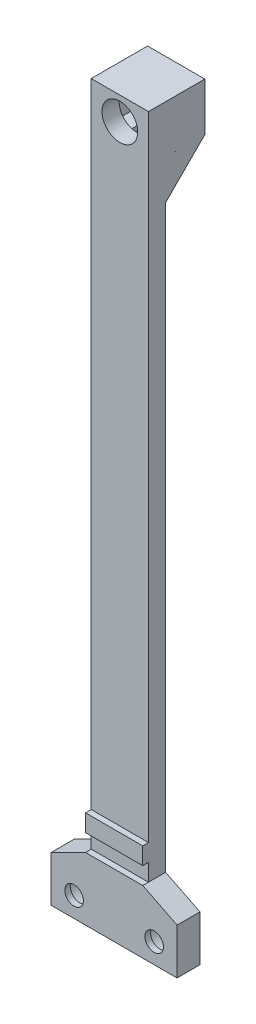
ISO-10303-21;
HEADER;
FILE_DESCRIPTION(('STEP AP214'),'2;1');
FILE_NAME('part.step','',(''),(''),'','','');
FILE_SCHEMA(('AUTOMOTIVE_DESIGN { 1 0 10303 214 1 1 1 1 }'));
ENDSEC;
DATA;
#1=APPLICATION_CONTEXT('core data for automotive mechanical design processes');
#2=APPLICATION_PROTOCOL_DEFINITION('international standard','automotive_design',2000,#1);
#3=PRODUCT_CONTEXT('',#1,'mechanical');
#4=PRODUCT('Part','Part','',(#3));
#5=PRODUCT_RELATED_PRODUCT_CATEGORY('part','',(#4));
#6=PRODUCT_DEFINITION_FORMATION('','',#4);
#7=PRODUCT_DEFINITION_CONTEXT('part definition',#1,'design');
#8=PRODUCT_DEFINITION('design','',#6,#7);
#9=PRODUCT_DEFINITION_SHAPE('','',#8);
#10=(LENGTH_UNIT() NAMED_UNIT(*) SI_UNIT(.MILLI.,.METRE.));
#11=(NAMED_UNIT(*) PLANE_ANGLE_UNIT() SI_UNIT($,.RADIAN.));
#12=(NAMED_UNIT(*) SI_UNIT($,.STERADIAN.) SOLID_ANGLE_UNIT());
#13=UNCERTAINTY_MEASURE_WITH_UNIT(LENGTH_MEASURE(1.E-05),#10,'distance_accuracy_value','');
#14=(GEOMETRIC_REPRESENTATION_CONTEXT(3) GLOBAL_UNCERTAINTY_ASSIGNED_CONTEXT((#13)) GLOBAL_UNIT_ASSIGNED_CONTEXT((#10,
#11,#12)) REPRESENTATION_CONTEXT('',''));
#15=CARTESIAN_POINT('',(0.,0.,0.));
#16=DIRECTION('',(0.,0.,1.));
#17=DIRECTION('',(1.,0.,0.));
#18=AXIS2_PLACEMENT_3D('',#15,#16,#17);
#19=CARTESIAN_POINT('',(0.,0.,0.));
#20=DIRECTION('',(0.,0.,-1.));
#21=DIRECTION('',(-1.,0.,0.));
#22=AXIS2_PLACEMENT_3D('',#19,#20,#21);
#23=PLANE('',#22);
#24=DIRECTION('',(-1.,0.,0.));
#25=VECTOR('',#24,1.);
#26=CARTESIAN_POINT('',(5.,54.698516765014,0.));
#27=LINE('',#26,#25);
#28=CARTESIAN_POINT('',(5.,54.698516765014,0.));
#29=VERTEX_POINT('',#28);
#30=CARTESIAN_POINT('',(-1.48874703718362,54.698516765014,0.));
#31=VERTEX_POINT('',#30);
#32=EDGE_CURVE('E418',#29,#31,#27,.T.);
#33=ORIENTED_EDGE('',*,*,#32,.T.);
#34=DIRECTION('',(0.,-1.,0.));
#35=VECTOR('',#34,1.);
#36=CARTESIAN_POINT('',(-1.4887470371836,0.,0.));
#37=LINE('',#36,#35);
#38=CARTESIAN_POINT('',(-1.48874703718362,55.498516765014,0.));
#39=VERTEX_POINT('',#38);
#40=EDGE_CURVE('E11',#39,#31,#37,.T.);
#41=ORIENTED_EDGE('',*,*,#40,.F.);
#42=DIRECTION('',(1.,0.,0.));
#43=VECTOR('',#42,1.);
#44=CARTESIAN_POINT('',(0.,55.498516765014,0.));
#45=LINE('',#44,#43);
#46=CARTESIAN_POINT('',(-4.2,55.498516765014,0.));
#47=VERTEX_POINT('',#46);
#48=EDGE_CURVE('E50',#47,#39,#45,.T.);
#49=ORIENTED_EDGE('',*,*,#48,.F.);
#50=DIRECTION('',(0.,-1.,0.));
#51=VECTOR('',#50,1.);
#52=CARTESIAN_POINT('',(-4.2,0.,0.));
#53=LINE('',#52,#51);
#54=CARTESIAN_POINT('',(-4.2,62.3185167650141,0.));
#55=VERTEX_POINT('',#54);
#56=EDGE_CURVE('E373',#55,#47,#53,.T.);
#57=ORIENTED_EDGE('',*,*,#56,.F.);
#58=DIRECTION('',(-1.,0.,0.));
#59=VECTOR('',#58,1.);
#60=CARTESIAN_POINT('',(0.,62.3185167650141,0.));
#61=LINE('',#60,#59);
#62=CARTESIAN_POINT('',(4.2,62.3185167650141,0.));
#63=VERTEX_POINT('',#62);
#64=EDGE_CURVE('E370',#63,#55,#61,.T.);
#65=ORIENTED_EDGE('',*,*,#64,.F.);
#66=DIRECTION('',(0.,1.,0.));
#67=VECTOR('',#66,1.);
#68=CARTESIAN_POINT('',(4.2,0.,0.));
#69=LINE('',#68,#67);
#70=CARTESIAN_POINT('',(4.2,55.4993335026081,0.));
#71=VERTEX_POINT('',#70);
#72=EDGE_CURVE('E367',#71,#63,#69,.T.);
#73=ORIENTED_EDGE('',*,*,#72,.F.);
#74=DIRECTION('',(1.,0.,0.));
#75=VECTOR('',#74,1.);
#76=CARTESIAN_POINT('',(1.18144171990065E-13,55.4993335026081,0.));
#77=LINE('',#76,#75);
#78=CARTESIAN_POINT('',(0.940389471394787,55.4993335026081,0.));
#79=VERTEX_POINT('',#78);
#80=EDGE_CURVE('E364',#79,#71,#77,.T.);
#81=ORIENTED_EDGE('',*,*,#80,.F.);
#82=DIRECTION('',(0.,1.,0.));
#83=VECTOR('',#82,1.);
#84=CARTESIAN_POINT('',(0.940389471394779,0.,0.));
#85=LINE('',#84,#83);
#86=CARTESIAN_POINT('',(0.940389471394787,54.6993335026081,0.));
#87=VERTEX_POINT('',#86);
#88=EDGE_CURVE('E361',#87,#79,#85,.T.);
#89=ORIENTED_EDGE('',*,*,#88,.F.);
#90=DIRECTION('',(-1.,0.,0.));
#91=VECTOR('',#90,1.);
#92=CARTESIAN_POINT('',(0.,54.6993335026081,0.));
#93=LINE('',#92,#91);
#94=CARTESIAN_POINT('',(5.,54.6993335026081,0.));
#95=VERTEX_POINT('',#94);
#96=EDGE_CURVE('E276',#95,#87,#93,.T.);
#97=ORIENTED_EDGE('',*,*,#96,.F.);
#98=DIRECTION('',(0.,1.,0.));
#99=VECTOR('',#98,1.);
#100=CARTESIAN_POINT('',(5.,-62.5,0.));
#101=LINE('',#100,#99);
#102=EDGE_CURVE('E346',#29,#95,#101,.T.);
#103=ORIENTED_EDGE('',*,*,#102,.F.);
#104=EDGE_LOOP('',(#33,#41,#49,#57,#65,#73,#81,#89,#97,#103));
#105=FACE_BOUND('',#104,.T.);
#106=CARTESIAN_POINT('',(0.,59.07,0.));
#107=DIRECTION('',(0.,0.,-1.));
#108=DIRECTION('',(-1.,0.,0.));
#109=AXIS2_PLACEMENT_3D('',#106,#107,#108);
#110=CIRCLE('',#109,3.125);
#111=CARTESIAN_POINT('',(-3.125,59.07,0.));
#112=VERTEX_POINT('',#111);
#113=EDGE_CURVE('E307',#112,#112,#110,.T.);
#114=ORIENTED_EDGE('',*,*,#113,.F.);
#115=EDGE_LOOP('',(#114));
#116=FACE_BOUND('',#115,.T.);
#117=ADVANCED_FACE('F41',(#105,#116),#23,.T.);
#118=CARTESIAN_POINT('',(-5.,-62.5,3.));
#119=DIRECTION('',(1.,0.,0.));
#120=DIRECTION('',(0.,0.,-1.));
#121=AXIS2_PLACEMENT_3D('',#118,#119,#120);
#122=PLANE('',#121);
#123=DIRECTION('',(0.,0.,-1.));
#124=VECTOR('',#123,1.);
#125=CARTESIAN_POINT('',(-5.,63.118516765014,3.));
#126=LINE('',#125,#124);
#127=CARTESIAN_POINT('',(-5.,63.118516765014,3.));
#128=VERTEX_POINT('',#127);
#129=CARTESIAN_POINT('',(-5.,63.118516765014,-6.84748427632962));
#130=VERTEX_POINT('',#129);
#131=EDGE_CURVE('E231',#128,#130,#126,.T.);
#132=ORIENTED_EDGE('',*,*,#131,.T.);
#133=DIRECTION('',(0.,-1.,0.));
#134=VECTOR('',#133,1.);
#135=CARTESIAN_POINT('',(-5.,51.8399888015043,-6.84748427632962));
#136=LINE('',#135,#134);
#137=CARTESIAN_POINT('',(-5.,54.698516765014,-6.84748427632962));
#138=VERTEX_POINT('',#137);
#139=EDGE_CURVE('E210',#130,#138,#136,.T.);
#140=ORIENTED_EDGE('',*,*,#139,.T.);
#141=DIRECTION('',(0.,-0.707106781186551,0.707106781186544));
#142=VECTOR('',#141,1.);
#143=CARTESIAN_POINT('',(-5.,54.698516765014,-6.84748427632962));
#144=LINE('',#143,#142);
#145=CARTESIAN_POINT('',(-5.,47.8510324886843,0.));
#146=VERTEX_POINT('',#145);
#147=EDGE_CURVE('E401',#138,#146,#144,.T.);
#148=ORIENTED_EDGE('',*,*,#147,.T.);
#149=DIRECTION('',(0.,-1.,0.));
#150=VECTOR('',#149,1.);
#151=CARTESIAN_POINT('',(-5.,-62.5,0.));
#152=LINE('',#151,#150);
#153=CARTESIAN_POINT('',(-5.,-53.5,0.));
#154=VERTEX_POINT('',#153);
#155=EDGE_CURVE('E355',#146,#154,#152,.T.);
#156=ORIENTED_EDGE('',*,*,#155,.T.);
#157=DIRECTION('',(0.,0.,-1.));
#158=VECTOR('',#157,1.);
#159=CARTESIAN_POINT('',(-5.,-53.5,4.));
#160=LINE('',#159,#158);
#161=CARTESIAN_POINT('',(-5.,-53.5,3.));
#162=VERTEX_POINT('',#161);
#163=EDGE_CURVE('E277',#162,#154,#160,.T.);
#164=ORIENTED_EDGE('',*,*,#163,.F.);
#165=DIRECTION('',(0.,-1.,0.));
#166=VECTOR('',#165,1.);
#167=CARTESIAN_POINT('',(-5.,-62.5,3.));
#168=LINE('',#167,#166);
#169=CARTESIAN_POINT('',(-5.,-50.5,3.));
#170=VERTEX_POINT('',#169);
#171=EDGE_CURVE('E349',#170,#162,#168,.T.);
#172=ORIENTED_EDGE('',*,*,#171,.F.);
#173=DIRECTION('',(0.,0.,-1.));
#174=VECTOR('',#173,1.);
#175=CARTESIAN_POINT('',(-5.,-50.5,4.));
#176=LINE('',#175,#174);
#177=CARTESIAN_POINT('',(-5.,-50.5,4.));
#178=VERTEX_POINT('',#177);
#179=EDGE_CURVE('E308',#178,#170,#176,.T.);
#180=ORIENTED_EDGE('',*,*,#179,.F.);
#181=DIRECTION('',(0.,-1.,0.));
#182=VECTOR('',#181,1.);
#183=CARTESIAN_POINT('',(-5.,-47.5,4.));
#184=LINE('',#183,#182);
#185=CARTESIAN_POINT('',(-5.,-47.5,4.));
#186=VERTEX_POINT('',#185);
#187=EDGE_CURVE('E325',#186,#178,#184,.T.);
#188=ORIENTED_EDGE('',*,*,#187,.F.);
#189=DIRECTION('',(0.,0.,-1.));
#190=VECTOR('',#189,1.);
#191=CARTESIAN_POINT('',(-5.,-47.5,4.));
#192=LINE('',#191,#190);
#193=CARTESIAN_POINT('',(-5.,-47.5,3.));
#194=VERTEX_POINT('',#193);
#195=EDGE_CURVE('E317',#186,#194,#192,.T.);
#196=ORIENTED_EDGE('',*,*,#195,.T.);
#197=EDGE_CURVE('E302',#128,#194,#168,.T.);
#198=ORIENTED_EDGE('',*,*,#197,.F.);
#199=EDGE_LOOP('',(#132,#140,#148,#156,#164,#172,#180,#188,#196,#198));
#200=FACE_BOUND('',#199,.T.);
#201=ADVANCED_FACE('F427',(#200),#122,.F.);
#202=CARTESIAN_POINT('',(0.,0.,3.));
#203=DIRECTION('',(0.,0.,-1.));
#204=DIRECTION('',(-1.,0.,0.));
#205=AXIS2_PLACEMENT_3D('',#202,#203,#204);
#206=PLANE('',#205);
#207=DIRECTION('',(1.,0.,0.));
#208=VECTOR('',#207,1.);
#209=CARTESIAN_POINT('',(-5.,-50.5,3.));
#210=LINE('',#209,#208);
#211=CARTESIAN_POINT('',(5.,-50.5,3.));
#212=VERTEX_POINT('',#211);
#213=EDGE_CURVE('E324',#170,#212,#210,.T.);
#214=ORIENTED_EDGE('',*,*,#213,.F.);
#215=ORIENTED_EDGE('',*,*,#171,.T.);
#216=DIRECTION('',(-1.,0.,0.));
#217=VECTOR('',#216,1.);
#218=CARTESIAN_POINT('',(5.,-53.5,3.));
#219=LINE('',#218,#217);
#220=CARTESIAN_POINT('',(5.,-53.5,3.));
#221=VERTEX_POINT('',#220);
#222=EDGE_CURVE('E328',#221,#162,#219,.T.);
#223=ORIENTED_EDGE('',*,*,#222,.F.);
#224=DIRECTION('',(0.,1.,0.));
#225=VECTOR('',#224,1.);
#226=CARTESIAN_POINT('',(5.,-62.5,3.));
#227=LINE('',#226,#225);
#228=EDGE_CURVE('E347',#221,#212,#227,.T.);
#229=ORIENTED_EDGE('',*,*,#228,.T.);
#230=EDGE_LOOP('',(#214,#215,#223,#229));
#231=FACE_BOUND('',#230,.T.);
#232=ADVANCED_FACE('F445',(#231),#206,.F.);
#233=ORIENTED_EDGE('',*,*,#197,.T.);
#234=DIRECTION('',(-1.,0.,0.));
#235=VECTOR('',#234,1.);
#236=CARTESIAN_POINT('',(-5.,-47.5,3.));
#237=LINE('',#236,#235);
#238=CARTESIAN_POINT('',(5.,-47.5,3.));
#239=VERTEX_POINT('',#238);
#240=EDGE_CURVE('E321',#239,#194,#237,.T.);
#241=ORIENTED_EDGE('',*,*,#240,.F.);
#242=CARTESIAN_POINT('',(5.,63.118516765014,3.));
#243=VERTEX_POINT('',#242);
#244=EDGE_CURVE('E350',#239,#243,#227,.T.);
#245=ORIENTED_EDGE('',*,*,#244,.T.);
#246=DIRECTION('',(1.,0.,0.));
#247=VECTOR('',#246,1.);
#248=CARTESIAN_POINT('',(5.,63.118516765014,3.));
#249=LINE('',#248,#247);
#250=EDGE_CURVE('E229',#128,#243,#249,.T.);
#251=ORIENTED_EDGE('',*,*,#250,.F.);
#252=EDGE_LOOP('',(#233,#241,#245,#251));
#253=FACE_BOUND('',#252,.T.);
#254=CARTESIAN_POINT('',(0.,59.07,3.));
#255=DIRECTION('',(0.,0.,1.));
#256=DIRECTION('',(1.,0.,0.));
#257=AXIS2_PLACEMENT_3D('',#254,#255,#256);
#258=CIRCLE('',#257,3.125);
#259=CARTESIAN_POINT('',(3.125,59.07,3.));
#260=VERTEX_POINT('',#259);
#261=EDGE_CURVE('E304',#260,#260,#258,.T.);
#262=ORIENTED_EDGE('',*,*,#261,.F.);
#263=EDGE_LOOP('',(#262));
#264=FACE_BOUND('',#263,.T.);
#265=ADVANCED_FACE('F494',(#253,#264),#206,.F.);
#266=CARTESIAN_POINT('',(5.,-62.5,3.));
#267=DIRECTION('',(-1.,0.,0.));
#268=DIRECTION('',(0.,0.,1.));
#269=AXIS2_PLACEMENT_3D('',#266,#267,#268);
#270=PLANE('',#269);
#271=DIRECTION('',(0.,0.,-1.));
#272=VECTOR('',#271,1.);
#273=CARTESIAN_POINT('',(5.,54.6993335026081,3.));
#274=LINE('',#273,#272);
#275=CARTESIAN_POINT('',(5.,54.6993335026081,-6.84748427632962));
#276=VERTEX_POINT('',#275);
#277=EDGE_CURVE('E225',#95,#276,#274,.T.);
#278=ORIENTED_EDGE('',*,*,#277,.T.);
#279=DIRECTION('',(0.,-1.,0.));
#280=VECTOR('',#279,1.);
#281=CARTESIAN_POINT('',(5.,51.8399888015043,-6.84748427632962));
#282=LINE('',#281,#280);
#283=CARTESIAN_POINT('',(5.,63.118516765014,-6.84748427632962));
#284=VERTEX_POINT('',#283);
#285=EDGE_CURVE('E207',#284,#276,#282,.T.);
#286=ORIENTED_EDGE('',*,*,#285,.F.);
#287=DIRECTION('',(0.,0.,-1.));
#288=VECTOR('',#287,1.);
#289=CARTESIAN_POINT('',(5.,63.118516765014,3.));
#290=LINE('',#289,#288);
#291=EDGE_CURVE('E222',#243,#284,#290,.T.);
#292=ORIENTED_EDGE('',*,*,#291,.F.);
#293=ORIENTED_EDGE('',*,*,#244,.F.);
#294=DIRECTION('',(0.,0.,-1.));
#295=VECTOR('',#294,1.);
#296=CARTESIAN_POINT('',(5.,-47.5,4.));
#297=LINE('',#296,#295);
#298=CARTESIAN_POINT('',(5.,-47.5,4.));
#299=VERTEX_POINT('',#298);
#300=EDGE_CURVE('E314',#299,#239,#297,.T.);
#301=ORIENTED_EDGE('',*,*,#300,.F.);
#302=DIRECTION('',(0.,1.,0.));
#303=VECTOR('',#302,1.);
#304=CARTESIAN_POINT('',(5.,-47.5,4.));
#305=LINE('',#304,#303);
#306=CARTESIAN_POINT('',(5.,-50.5,4.));
#307=VERTEX_POINT('',#306);
#308=EDGE_CURVE('E330',#307,#299,#305,.T.);
#309=ORIENTED_EDGE('',*,*,#308,.F.);
#310=DIRECTION('',(0.,0.,-1.));
#311=VECTOR('',#310,1.);
#312=CARTESIAN_POINT('',(5.,-50.5,4.));
#313=LINE('',#312,#311);
#314=EDGE_CURVE('E311',#307,#212,#313,.T.);
#315=ORIENTED_EDGE('',*,*,#314,.T.);
#316=ORIENTED_EDGE('',*,*,#228,.F.);
#317=DIRECTION('',(0.,0.,-1.));
#318=VECTOR('',#317,1.);
#319=CARTESIAN_POINT('',(5.,-53.5,4.));
#320=LINE('',#319,#318);
#321=CARTESIAN_POINT('',(5.,-53.5,0.));
#322=VERTEX_POINT('',#321);
#323=EDGE_CURVE('E273',#221,#322,#320,.T.);
#324=ORIENTED_EDGE('',*,*,#323,.T.);
#325=CARTESIAN_POINT('',(5.,47.8510324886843,0.));
#326=VERTEX_POINT('',#325);
#327=EDGE_CURVE('E352',#322,#326,#101,.T.);
#328=ORIENTED_EDGE('',*,*,#327,.T.);
#329=DIRECTION('',(0.,-0.707106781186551,0.707106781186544));
#330=VECTOR('',#329,1.);
#331=CARTESIAN_POINT('',(5.,54.698516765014,-6.84748427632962));
#332=LINE('',#331,#330);
#333=CARTESIAN_POINT('',(5.,54.698516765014,-6.84748427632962));
#334=VERTEX_POINT('',#333);
#335=EDGE_CURVE('E413',#334,#326,#332,.T.);
#336=ORIENTED_EDGE('',*,*,#335,.F.);
#337=DIRECTION('',(0.,0.,-1.));
#338=VECTOR('',#337,1.);
#339=CARTESIAN_POINT('',(5.,54.698516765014,0.));
#340=LINE('',#339,#338);
#341=EDGE_CURVE('E410',#29,#334,#340,.T.);
#342=ORIENTED_EDGE('',*,*,#341,.F.);
#343=ORIENTED_EDGE('',*,*,#102,.T.);
#344=EDGE_LOOP('',(#278,#286,#292,#293,#301,#309,#315,#316,#324,#328,#336,#342,#343));
#345=FACE_BOUND('',#344,.T.);
#346=ADVANCED_FACE('F43',(#345),#270,.F.);
#347=CARTESIAN_POINT('',(-7.,-61.,0.));
#348=DIRECTION('',(0.,0.,-1.));
#349=DIRECTION('',(-1.,0.,0.));
#350=AXIS2_PLACEMENT_3D('',#347,#348,#349);
#351=CIRCLE('',#350,3.);
#352=CARTESIAN_POINT('',(-10.,-61.,0.));
#353=VERTEX_POINT('',#352);
#354=EDGE_CURVE('E402',#353,#353,#351,.T.);
#355=ORIENTED_EDGE('',*,*,#354,.F.);
#356=EDGE_LOOP('',(#355));
#357=FACE_BOUND('',#356,.T.);
#358=CARTESIAN_POINT('',(7.,-61.,0.));
#359=DIRECTION('',(0.,0.,-1.));
#360=DIRECTION('',(-1.,0.,0.));
#361=AXIS2_PLACEMENT_3D('',#358,#359,#360);
#362=CIRCLE('',#361,3.);
#363=CARTESIAN_POINT('',(3.99999999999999,-61.,0.));
#364=VERTEX_POINT('',#363);
#365=EDGE_CURVE('E405',#364,#364,#362,.T.);
#366=ORIENTED_EDGE('',*,*,#365,.F.);
#367=EDGE_LOOP('',(#366));
#368=FACE_BOUND('',#367,.T.);
#369=DIRECTION('',(-1.,0.,0.));
#370=VECTOR('',#369,1.);
#371=CARTESIAN_POINT('',(5.,47.8510324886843,0.));
#372=LINE('',#371,#370);
#373=EDGE_CURVE('E420',#326,#146,#372,.T.);
#374=ORIENTED_EDGE('',*,*,#373,.F.);
#375=ORIENTED_EDGE('',*,*,#327,.F.);
#376=DIRECTION('',(0.894427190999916,-0.447213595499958,0.));
#377=VECTOR('',#376,1.);
#378=CARTESIAN_POINT('',(11.,-56.5,0.));
#379=LINE('',#378,#377);
#380=CARTESIAN_POINT('',(11.,-56.5,0.));
#381=VERTEX_POINT('',#380);
#382=EDGE_CURVE('E280',#322,#381,#379,.T.);
#383=ORIENTED_EDGE('',*,*,#382,.T.);
#384=DIRECTION('',(0.,-1.,0.));
#385=VECTOR('',#384,1.);
#386=CARTESIAN_POINT('',(11.,-62.5,0.));
#387=LINE('',#386,#385);
#388=CARTESIAN_POINT('',(11.,-64.5,0.));
#389=VERTEX_POINT('',#388);
#390=EDGE_CURVE('E278',#381,#389,#387,.T.);
#391=ORIENTED_EDGE('',*,*,#390,.T.);
#392=DIRECTION('',(1.,0.,0.));
#393=VECTOR('',#392,1.);
#394=CARTESIAN_POINT('',(-11.,-64.5,0.));
#395=LINE('',#394,#393);
#396=CARTESIAN_POINT('',(-11.,-64.5,0.));
#397=VERTEX_POINT('',#396);
#398=EDGE_CURVE('E234',#397,#389,#395,.T.);
#399=ORIENTED_EDGE('',*,*,#398,.F.);
#400=DIRECTION('',(0.,1.,0.));
#401=VECTOR('',#400,1.);
#402=CARTESIAN_POINT('',(-11.,-62.5,0.));
#403=LINE('',#402,#401);
#404=CARTESIAN_POINT('',(-11.,-56.5,0.));
#405=VERTEX_POINT('',#404);
#406=EDGE_CURVE('E284',#397,#405,#403,.T.);
#407=ORIENTED_EDGE('',*,*,#406,.T.);
#408=DIRECTION('',(0.894427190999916,0.447213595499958,0.));
#409=VECTOR('',#408,1.);
#410=CARTESIAN_POINT('',(-11.,-56.5,0.));
#411=LINE('',#410,#409);
#412=EDGE_CURVE('E292',#405,#154,#411,.T.);
#413=ORIENTED_EDGE('',*,*,#412,.T.);
#414=ORIENTED_EDGE('',*,*,#155,.F.);
#415=EDGE_LOOP('',(#374,#375,#383,#391,#399,#407,#413,#414));
#416=FACE_BOUND('',#415,.T.);
#417=ADVANCED_FACE('F435',(#357,#368,#416),#23,.T.);
#418=CARTESIAN_POINT('',(5.,-53.5,4.));
#419=DIRECTION('',(0.,-1.,0.));
#420=DIRECTION('',(0.,0.,-1.));
#421=AXIS2_PLACEMENT_3D('',#418,#419,#420);
#422=PLANE('',#421);
#423=ORIENTED_EDGE('',*,*,#222,.T.);
#424=DIRECTION('',(0.,0.,-1.));
#425=VECTOR('',#424,1.);
#426=CARTESIAN_POINT('',(-5.,-53.5,4.));
#427=LINE('',#426,#425);
#428=CARTESIAN_POINT('',(-5.,-53.5,4.));
#429=VERTEX_POINT('',#428);
#430=EDGE_CURVE('E338',#429,#162,#427,.T.);
#431=ORIENTED_EDGE('',*,*,#430,.F.);
#432=DIRECTION('',(-1.,0.,0.));
#433=VECTOR('',#432,1.);
#434=CARTESIAN_POINT('',(5.,-53.5,4.));
#435=LINE('',#434,#433);
#436=CARTESIAN_POINT('',(5.,-53.5,4.));
#437=VERTEX_POINT('',#436);
#438=EDGE_CURVE('E336',#437,#429,#435,.T.);
#439=ORIENTED_EDGE('',*,*,#438,.F.);
#440=DIRECTION('',(0.,0.,-1.));
#441=VECTOR('',#440,1.);
#442=CARTESIAN_POINT('',(5.,-53.5,4.));
#443=LINE('',#442,#441);
#444=EDGE_CURVE('E343',#437,#221,#443,.T.);
#445=ORIENTED_EDGE('',*,*,#444,.T.);
#446=EDGE_LOOP('',(#423,#431,#439,#445));
#447=FACE_BOUND('',#446,.T.);
#448=ADVANCED_FACE('F448',(#447),#422,.F.);
#449=CARTESIAN_POINT('',(0.,0.,4.));
#450=DIRECTION('',(0.,0.,1.));
#451=DIRECTION('',(1.,0.,0.));
#452=AXIS2_PLACEMENT_3D('',#449,#450,#451);
#453=PLANE('',#452);
#454=CARTESIAN_POINT('',(7.,-61.,4.));
#455=DIRECTION('',(0.,0.,1.));
#456=DIRECTION('',(1.,0.,0.));
#457=AXIS2_PLACEMENT_3D('',#454,#455,#456);
#458=CIRCLE('',#457,1.625);
#459=CARTESIAN_POINT('',(8.625,-61.,4.));
#460=VERTEX_POINT('',#459);
#461=EDGE_CURVE('E45',#460,#460,#458,.T.);
#462=ORIENTED_EDGE('',*,*,#461,.F.);
#463=EDGE_LOOP('',(#462));
#464=FACE_BOUND('',#463,.T.);
#465=CARTESIAN_POINT('',(-7.,-61.,4.));
#466=DIRECTION('',(0.,0.,1.));
#467=DIRECTION('',(1.,0.,0.));
#468=AXIS2_PLACEMENT_3D('',#465,#466,#467);
#469=CIRCLE('',#468,1.625);
#470=CARTESIAN_POINT('',(-5.375,-61.,4.));
#471=VERTEX_POINT('',#470);
#472=EDGE_CURVE('E383',#471,#471,#469,.T.);
#473=ORIENTED_EDGE('',*,*,#472,.F.);
#474=EDGE_LOOP('',(#473));
#475=FACE_BOUND('',#474,.T.);
#476=DIRECTION('',(0.,1.,0.));
#477=VECTOR('',#476,1.);
#478=CARTESIAN_POINT('',(-11.,-62.5,4.));
#479=LINE('',#478,#477);
#480=CARTESIAN_POINT('',(-11.,-64.5,4.));
#481=VERTEX_POINT('',#480);
#482=CARTESIAN_POINT('',(-11.,-56.5,4.));
#483=VERTEX_POINT('',#482);
#484=EDGE_CURVE('E288',#481,#483,#479,.T.);
#485=ORIENTED_EDGE('',*,*,#484,.F.);
#486=DIRECTION('',(1.,0.,0.));
#487=VECTOR('',#486,1.);
#488=CARTESIAN_POINT('',(-11.,-64.5,4.));
#489=LINE('',#488,#487);
#490=CARTESIAN_POINT('',(11.,-64.5,4.));
#491=VERTEX_POINT('',#490);
#492=EDGE_CURVE('E230',#481,#491,#489,.T.);
#493=ORIENTED_EDGE('',*,*,#492,.T.);
#494=DIRECTION('',(0.,-1.,0.));
#495=VECTOR('',#494,1.);
#496=CARTESIAN_POINT('',(11.,-62.5,4.));
#497=LINE('',#496,#495);
#498=CARTESIAN_POINT('',(11.,-56.5,4.));
#499=VERTEX_POINT('',#498);
#500=EDGE_CURVE('E272',#499,#491,#497,.T.);
#501=ORIENTED_EDGE('',*,*,#500,.F.);
#502=DIRECTION('',(0.894427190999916,-0.447213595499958,0.));
#503=VECTOR('',#502,1.);
#504=CARTESIAN_POINT('',(11.,-56.5,4.));
#505=LINE('',#504,#503);
#506=EDGE_CURVE('E281',#437,#499,#505,.T.);
#507=ORIENTED_EDGE('',*,*,#506,.F.);
#508=ORIENTED_EDGE('',*,*,#438,.T.);
#509=DIRECTION('',(0.894427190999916,0.447213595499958,0.));
#510=VECTOR('',#509,1.);
#511=CARTESIAN_POINT('',(-11.,-56.5,4.));
#512=LINE('',#511,#510);
#513=EDGE_CURVE('E291',#483,#429,#512,.T.);
#514=ORIENTED_EDGE('',*,*,#513,.F.);
#515=EDGE_LOOP('',(#485,#493,#501,#507,#508,#514));
#516=FACE_BOUND('',#515,.T.);
#517=ADVANCED_FACE('F455',(#464,#475,#516),#453,.T.);
#518=CARTESIAN_POINT('',(-5.,-50.5,4.));
#519=DIRECTION('',(0.,1.,0.));
#520=DIRECTION('',(0.,0.,1.));
#521=AXIS2_PLACEMENT_3D('',#518,#519,#520);
#522=PLANE('',#521);
#523=ORIENTED_EDGE('',*,*,#213,.T.);
#524=ORIENTED_EDGE('',*,*,#314,.F.);
#525=DIRECTION('',(1.,0.,0.));
#526=VECTOR('',#525,1.);
#527=CARTESIAN_POINT('',(-5.,-50.5,4.));
#528=LINE('',#527,#526);
#529=EDGE_CURVE('E332',#178,#307,#528,.T.);
#530=ORIENTED_EDGE('',*,*,#529,.F.);
#531=ORIENTED_EDGE('',*,*,#179,.T.);
#532=EDGE_LOOP('',(#523,#524,#530,#531));
#533=FACE_BOUND('',#532,.T.);
#534=ADVANCED_FACE('F839',(#533),#522,.F.);
#535=CARTESIAN_POINT('',(-5.,-47.5,4.));
#536=DIRECTION('',(0.,-1.,0.));
#537=DIRECTION('',(1.,0.,0.));
#538=AXIS2_PLACEMENT_3D('',#535,#536,#537);
#539=PLANE('',#538);
#540=ORIENTED_EDGE('',*,*,#240,.T.);
#541=ORIENTED_EDGE('',*,*,#195,.F.);
#542=DIRECTION('',(-1.,0.,0.));
#543=VECTOR('',#542,1.);
#544=CARTESIAN_POINT('',(-5.,-47.5,4.));
#545=LINE('',#544,#543);
#546=EDGE_CURVE('E320',#299,#186,#545,.T.);
#547=ORIENTED_EDGE('',*,*,#546,.F.);
#548=ORIENTED_EDGE('',*,*,#300,.T.);
#549=EDGE_LOOP('',(#540,#541,#547,#548));
#550=FACE_BOUND('',#549,.T.);
#551=ADVANCED_FACE('F829',(#550),#539,.F.);
#552=CARTESIAN_POINT('',(0.,0.,4.));
#553=DIRECTION('',(0.,0.,1.));
#554=DIRECTION('',(1.,0.,0.));
#555=AXIS2_PLACEMENT_3D('',#552,#553,#554);
#556=PLANE('',#555);
#557=ORIENTED_EDGE('',*,*,#187,.T.);
#558=ORIENTED_EDGE('',*,*,#529,.T.);
#559=ORIENTED_EDGE('',*,*,#308,.T.);
#560=ORIENTED_EDGE('',*,*,#546,.T.);
#561=EDGE_LOOP('',(#557,#558,#559,#560));
#562=FACE_BOUND('',#561,.T.);
#563=ADVANCED_FACE('F819',(#562),#556,.T.);
#564=CARTESIAN_POINT('',(0.,59.07,-2.));
#565=DIRECTION('',(0.,0.,1.));
#566=DIRECTION('',(1.,0.,0.));
#567=AXIS2_PLACEMENT_3D('',#564,#565,#566);
#568=CYLINDRICAL_SURFACE('',#567,3.125);
#569=ORIENTED_EDGE('',*,*,#113,.T.);
#570=EDGE_LOOP('',(#569));
#571=FACE_BOUND('',#570,.T.);
#572=ORIENTED_EDGE('',*,*,#261,.T.);
#573=EDGE_LOOP('',(#572));
#574=FACE_BOUND('',#573,.T.);
#575=ADVANCED_FACE('F475',(#571,#574),#568,.F.);
#576=CARTESIAN_POINT('',(-11.,-56.5,4.));
#577=DIRECTION('',(-0.447213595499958,0.894427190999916,0.));
#578=DIRECTION('',(-0.894427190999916,-0.447213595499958,0.));
#579=AXIS2_PLACEMENT_3D('',#576,#577,#578);
#580=PLANE('',#579);
#581=ORIENTED_EDGE('',*,*,#412,.F.);
#582=DIRECTION('',(0.,0.,-1.));
#583=VECTOR('',#582,1.);
#584=CARTESIAN_POINT('',(-11.,-56.5,4.));
#585=LINE('',#584,#583);
#586=EDGE_CURVE('E295',#483,#405,#585,.T.);
#587=ORIENTED_EDGE('',*,*,#586,.F.);
#588=ORIENTED_EDGE('',*,*,#513,.T.);
#589=ORIENTED_EDGE('',*,*,#430,.T.);
#590=ORIENTED_EDGE('',*,*,#163,.T.);
#591=EDGE_LOOP('',(#581,#587,#588,#589,#590));
#592=FACE_BOUND('',#591,.T.);
#593=ADVANCED_FACE('F452',(#592),#580,.T.);
#594=CARTESIAN_POINT('',(-11.,-62.5,4.));
#595=DIRECTION('',(-1.,0.,0.));
#596=DIRECTION('',(0.,0.,1.));
#597=AXIS2_PLACEMENT_3D('',#594,#595,#596);
#598=PLANE('',#597);
#599=ORIENTED_EDGE('',*,*,#406,.F.);
#600=DIRECTION('',(0.,0.,1.));
#601=VECTOR('',#600,1.);
#602=CARTESIAN_POINT('',(-11.,-64.5,0.));
#603=LINE('',#602,#601);
#604=EDGE_CURVE('E263',#397,#481,#603,.T.);
#605=ORIENTED_EDGE('',*,*,#604,.T.);
#606=ORIENTED_EDGE('',*,*,#484,.T.);
#607=ORIENTED_EDGE('',*,*,#586,.T.);
#608=EDGE_LOOP('',(#599,#605,#606,#607));
#609=FACE_BOUND('',#608,.T.);
#610=ADVANCED_FACE('F467',(#609),#598,.T.);
#611=CARTESIAN_POINT('',(11.,-56.5,4.));
#612=DIRECTION('',(0.447213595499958,0.894427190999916,0.));
#613=DIRECTION('',(-0.894427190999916,0.447213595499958,0.));
#614=AXIS2_PLACEMENT_3D('',#611,#612,#613);
#615=PLANE('',#614);
#616=ORIENTED_EDGE('',*,*,#382,.F.);
#617=ORIENTED_EDGE('',*,*,#323,.F.);
#618=ORIENTED_EDGE('',*,*,#444,.F.);
#619=ORIENTED_EDGE('',*,*,#506,.T.);
#620=DIRECTION('',(0.,0.,-1.));
#621=VECTOR('',#620,1.);
#622=CARTESIAN_POINT('',(11.,-56.5,4.));
#623=LINE('',#622,#621);
#624=EDGE_CURVE('E268',#499,#381,#623,.T.);
#625=ORIENTED_EDGE('',*,*,#624,.T.);
#626=EDGE_LOOP('',(#616,#617,#618,#619,#625));
#627=FACE_BOUND('',#626,.T.);
#628=ADVANCED_FACE('F440',(#627),#615,.T.);
#629=CARTESIAN_POINT('',(11.,-62.5,4.));
#630=DIRECTION('',(1.,0.,0.));
#631=DIRECTION('',(0.,0.,-1.));
#632=AXIS2_PLACEMENT_3D('',#629,#630,#631);
#633=PLANE('',#632);
#634=ORIENTED_EDGE('',*,*,#390,.F.);
#635=ORIENTED_EDGE('',*,*,#624,.F.);
#636=ORIENTED_EDGE('',*,*,#500,.T.);
#637=DIRECTION('',(0.,0.,1.));
#638=VECTOR('',#637,1.);
#639=CARTESIAN_POINT('',(11.,-64.5,0.));
#640=LINE('',#639,#638);
#641=EDGE_CURVE('E265',#389,#491,#640,.T.);
#642=ORIENTED_EDGE('',*,*,#641,.F.);
#643=EDGE_LOOP('',(#634,#635,#636,#642));
#644=FACE_BOUND('',#643,.T.);
#645=ADVANCED_FACE('F460',(#644),#633,.T.);
#646=CARTESIAN_POINT('',(-11.,-64.5,0.));
#647=DIRECTION('',(0.,-1.,0.));
#648=DIRECTION('',(0.,0.,-1.));
#649=AXIS2_PLACEMENT_3D('',#646,#647,#648);
#650=PLANE('',#649);
#651=ORIENTED_EDGE('',*,*,#492,.F.);
#652=ORIENTED_EDGE('',*,*,#604,.F.);
#653=ORIENTED_EDGE('',*,*,#398,.T.);
#654=ORIENTED_EDGE('',*,*,#641,.T.);
#655=EDGE_LOOP('',(#651,#652,#653,#654));
#656=FACE_BOUND('',#655,.T.);
#657=ADVANCED_FACE('F465',(#656),#650,.T.);
#658=CARTESIAN_POINT('',(5.,63.118516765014,3.));
#659=DIRECTION('',(0.,1.,0.));
#660=DIRECTION('',(0.,0.,1.));
#661=AXIS2_PLACEMENT_3D('',#658,#659,#660);
#662=PLANE('',#661);
#663=DIRECTION('',(1.,0.,0.));
#664=VECTOR('',#663,1.);
#665=CARTESIAN_POINT('',(5.,63.118516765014,-6.84748427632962));
#666=LINE('',#665,#664);
#667=EDGE_CURVE('E204',#130,#284,#666,.T.);
#668=ORIENTED_EDGE('',*,*,#667,.F.);
#669=ORIENTED_EDGE('',*,*,#131,.F.);
#670=ORIENTED_EDGE('',*,*,#250,.T.);
#671=ORIENTED_EDGE('',*,*,#291,.T.);
#672=EDGE_LOOP('',(#668,#669,#670,#671));
#673=FACE_BOUND('',#672,.T.);
#674=ADVANCED_FACE('F227',(#673),#662,.T.);
#675=CARTESIAN_POINT('',(-1.48874703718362,54.698516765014,3.));
#676=DIRECTION('',(1.,0.,0.));
#677=DIRECTION('',(0.,1.,0.));
#678=AXIS2_PLACEMENT_3D('',#675,#676,#677);
#679=PLANE('',#678);
#680=DIRECTION('',(0.,-1.,0.));
#681=VECTOR('',#680,1.);
#682=CARTESIAN_POINT('',(-1.48874703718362,54.698516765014,-6.84748427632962));
#683=LINE('',#682,#681);
#684=CARTESIAN_POINT('',(-1.48874703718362,55.498516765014,-6.84748427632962));
#685=VERTEX_POINT('',#684);
#686=CARTESIAN_POINT('',(-1.48874703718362,54.698516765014,-6.84748427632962));
#687=VERTEX_POINT('',#686);
#688=EDGE_CURVE('E58',#685,#687,#683,.T.);
#689=ORIENTED_EDGE('',*,*,#688,.F.);
#690=DIRECTION('',(0.,0.,-1.));
#691=VECTOR('',#690,1.);
#692=CARTESIAN_POINT('',(-1.48874703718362,55.498516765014,3.));
#693=LINE('',#692,#691);
#694=EDGE_CURVE('E243',#39,#685,#693,.T.);
#695=ORIENTED_EDGE('',*,*,#694,.F.);
#696=ORIENTED_EDGE('',*,*,#40,.T.);
#697=DIRECTION('',(0.,0.,-1.));
#698=VECTOR('',#697,1.);
#699=CARTESIAN_POINT('',(-1.48874703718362,54.698516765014,3.));
#700=LINE('',#699,#698);
#701=EDGE_CURVE('E236',#31,#687,#700,.T.);
#702=ORIENTED_EDGE('',*,*,#701,.T.);
#703=EDGE_LOOP('',(#689,#695,#696,#702));
#704=FACE_BOUND('',#703,.T.);
#705=ADVANCED_FACE('F523',(#704),#679,.T.);
#706=CARTESIAN_POINT('',(-1.48874703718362,55.498516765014,3.));
#707=DIRECTION('',(0.,1.,0.));
#708=DIRECTION('',(0.,0.,1.));
#709=AXIS2_PLACEMENT_3D('',#706,#707,#708);
#710=PLANE('',#709);
#711=DIRECTION('',(1.,0.,0.));
#712=VECTOR('',#711,1.);
#713=CARTESIAN_POINT('',(-1.48874703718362,55.498516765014,-6.84748427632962));
#714=LINE('',#713,#712);
#715=CARTESIAN_POINT('',(-4.2,55.498516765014,-6.84748427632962));
#716=VERTEX_POINT('',#715);
#717=EDGE_CURVE('E961',#716,#685,#714,.T.);
#718=ORIENTED_EDGE('',*,*,#717,.F.);
#719=DIRECTION('',(0.,0.,-1.));
#720=VECTOR('',#719,1.);
#721=CARTESIAN_POINT('',(-4.2,55.498516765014,3.));
#722=LINE('',#721,#720);
#723=EDGE_CURVE('E246',#47,#716,#722,.T.);
#724=ORIENTED_EDGE('',*,*,#723,.F.);
#725=ORIENTED_EDGE('',*,*,#48,.T.);
#726=ORIENTED_EDGE('',*,*,#694,.T.);
#727=EDGE_LOOP('',(#718,#724,#725,#726));
#728=FACE_BOUND('',#727,.T.);
#729=ADVANCED_FACE('F526',(#728),#710,.T.);
#730=CARTESIAN_POINT('',(-4.2,55.498516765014,3.));
#731=DIRECTION('',(1.,0.,0.));
#732=DIRECTION('',(0.,0.,-1.));
#733=AXIS2_PLACEMENT_3D('',#730,#731,#732);
#734=PLANE('',#733);
#735=DIRECTION('',(0.,-1.,0.));
#736=VECTOR('',#735,1.);
#737=CARTESIAN_POINT('',(-4.2,55.498516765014,-6.84748427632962));
#738=LINE('',#737,#736);
#739=CARTESIAN_POINT('',(-4.2,62.3185167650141,-6.84748427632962));
#740=VERTEX_POINT('',#739);
#741=EDGE_CURVE('E959',#740,#716,#738,.T.);
#742=ORIENTED_EDGE('',*,*,#741,.F.);
#743=DIRECTION('',(0.,0.,-1.));
#744=VECTOR('',#743,1.);
#745=CARTESIAN_POINT('',(-4.2,62.3185167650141,3.));
#746=LINE('',#745,#744);
#747=EDGE_CURVE('E249',#55,#740,#746,.T.);
#748=ORIENTED_EDGE('',*,*,#747,.F.);
#749=ORIENTED_EDGE('',*,*,#56,.T.);
#750=ORIENTED_EDGE('',*,*,#723,.T.);
#751=EDGE_LOOP('',(#742,#748,#749,#750));
#752=FACE_BOUND('',#751,.T.);
#753=ADVANCED_FACE('F530',(#752),#734,.T.);
#754=CARTESIAN_POINT('',(-4.2,62.3185167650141,3.));
#755=DIRECTION('',(0.,-1.,0.));
#756=DIRECTION('',(0.,0.,-1.));
#757=AXIS2_PLACEMENT_3D('',#754,#755,#756);
#758=PLANE('',#757);
#759=DIRECTION('',(-1.,0.,0.));
#760=VECTOR('',#759,1.);
#761=CARTESIAN_POINT('',(-4.2,62.3185167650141,-6.84748427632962));
#762=LINE('',#761,#760);
#763=CARTESIAN_POINT('',(4.2,62.3185167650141,-6.84748427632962));
#764=VERTEX_POINT('',#763);
#765=EDGE_CURVE('E957',#764,#740,#762,.T.);
#766=ORIENTED_EDGE('',*,*,#765,.F.);
#767=DIRECTION('',(0.,0.,-1.));
#768=VECTOR('',#767,1.);
#769=CARTESIAN_POINT('',(4.2,62.3185167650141,3.));
#770=LINE('',#769,#768);
#771=EDGE_CURVE('E252',#63,#764,#770,.T.);
#772=ORIENTED_EDGE('',*,*,#771,.F.);
#773=ORIENTED_EDGE('',*,*,#64,.T.);
#774=ORIENTED_EDGE('',*,*,#747,.T.);
#775=EDGE_LOOP('',(#766,#772,#773,#774));
#776=FACE_BOUND('',#775,.T.);
#777=ADVANCED_FACE('F534',(#776),#758,.T.);
#778=CARTESIAN_POINT('',(4.2,62.3185167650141,3.));
#779=DIRECTION('',(-1.,0.,0.));
#780=DIRECTION('',(0.,0.,1.));
#781=AXIS2_PLACEMENT_3D('',#778,#779,#780);
#782=PLANE('',#781);
#783=DIRECTION('',(0.,1.,0.));
#784=VECTOR('',#783,1.);
#785=CARTESIAN_POINT('',(4.2,62.3185167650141,-6.84748427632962));
#786=LINE('',#785,#784);
#787=CARTESIAN_POINT('',(4.2,55.4993335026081,-6.84748427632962));
#788=VERTEX_POINT('',#787);
#789=EDGE_CURVE('E955',#788,#764,#786,.T.);
#790=ORIENTED_EDGE('',*,*,#789,.F.);
#791=DIRECTION('',(0.,0.,-1.));
#792=VECTOR('',#791,1.);
#793=CARTESIAN_POINT('',(4.2,55.4993335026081,3.));
#794=LINE('',#793,#792);
#795=EDGE_CURVE('E255',#71,#788,#794,.T.);
#796=ORIENTED_EDGE('',*,*,#795,.F.);
#797=ORIENTED_EDGE('',*,*,#72,.T.);
#798=ORIENTED_EDGE('',*,*,#771,.T.);
#799=EDGE_LOOP('',(#790,#796,#797,#798));
#800=FACE_BOUND('',#799,.T.);
#801=ADVANCED_FACE('F538',(#800),#782,.T.);
#802=CARTESIAN_POINT('',(4.2,55.4993335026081,3.));
#803=DIRECTION('',(0.,1.,0.));
#804=DIRECTION('',(-1.,0.,0.));
#805=AXIS2_PLACEMENT_3D('',#802,#803,#804);
#806=PLANE('',#805);
#807=DIRECTION('',(1.,0.,0.));
#808=VECTOR('',#807,1.);
#809=CARTESIAN_POINT('',(4.2,55.4993335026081,-6.84748427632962));
#810=LINE('',#809,#808);
#811=CARTESIAN_POINT('',(0.940389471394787,55.4993335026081,-6.84748427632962));
#812=VERTEX_POINT('',#811);
#813=EDGE_CURVE('E951',#812,#788,#810,.T.);
#814=ORIENTED_EDGE('',*,*,#813,.F.);
#815=DIRECTION('',(0.,0.,-1.));
#816=VECTOR('',#815,1.);
#817=CARTESIAN_POINT('',(0.940389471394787,55.4993335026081,3.));
#818=LINE('',#817,#816);
#819=EDGE_CURVE('E258',#79,#812,#818,.T.);
#820=ORIENTED_EDGE('',*,*,#819,.F.);
#821=ORIENTED_EDGE('',*,*,#80,.T.);
#822=ORIENTED_EDGE('',*,*,#795,.T.);
#823=EDGE_LOOP('',(#814,#820,#821,#822));
#824=FACE_BOUND('',#823,.T.);
#825=ADVANCED_FACE('F542',(#824),#806,.T.);
#826=CARTESIAN_POINT('',(0.940389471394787,54.6993335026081,3.));
#827=DIRECTION('',(-1.,0.,0.));
#828=DIRECTION('',(0.,-1.,0.));
#829=AXIS2_PLACEMENT_3D('',#826,#827,#828);
#830=PLANE('',#829);
#831=DIRECTION('',(0.,1.,0.));
#832=VECTOR('',#831,1.);
#833=CARTESIAN_POINT('',(0.940389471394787,54.6993335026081,-6.84748427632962));
#834=LINE('',#833,#832);
#835=CARTESIAN_POINT('',(0.940389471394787,54.6993335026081,-6.84748427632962));
#836=VERTEX_POINT('',#835);
#837=EDGE_CURVE('E950',#836,#812,#834,.T.);
#838=ORIENTED_EDGE('',*,*,#837,.F.);
#839=DIRECTION('',(0.,0.,-1.));
#840=VECTOR('',#839,1.);
#841=CARTESIAN_POINT('',(0.940389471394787,54.6993335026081,3.));
#842=LINE('',#841,#840);
#843=EDGE_CURVE('E261',#87,#836,#842,.T.);
#844=ORIENTED_EDGE('',*,*,#843,.F.);
#845=ORIENTED_EDGE('',*,*,#88,.T.);
#846=ORIENTED_EDGE('',*,*,#819,.T.);
#847=EDGE_LOOP('',(#838,#844,#845,#846));
#848=FACE_BOUND('',#847,.T.);
#849=ADVANCED_FACE('F546',(#848),#830,.T.);
#850=CARTESIAN_POINT('',(5.,54.6993335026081,3.));
#851=DIRECTION('',(0.,-1.,0.));
#852=DIRECTION('',(0.,0.,-1.));
#853=AXIS2_PLACEMENT_3D('',#850,#851,#852);
#854=PLANE('',#853);
#855=DIRECTION('',(-1.,0.,0.));
#856=VECTOR('',#855,1.);
#857=CARTESIAN_POINT('',(5.,54.6993335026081,-6.84748427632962));
#858=LINE('',#857,#856);
#859=EDGE_CURVE('E216',#276,#836,#858,.T.);
#860=ORIENTED_EDGE('',*,*,#859,.F.);
#861=ORIENTED_EDGE('',*,*,#277,.F.);
#862=ORIENTED_EDGE('',*,*,#96,.T.);
#863=ORIENTED_EDGE('',*,*,#843,.T.);
#864=EDGE_LOOP('',(#860,#861,#862,#863));
#865=FACE_BOUND('',#864,.T.);
#866=ADVANCED_FACE('F520',(#865),#854,.T.);
#867=CARTESIAN_POINT('',(5.,54.698516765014,0.));
#868=DIRECTION('',(0.,1.,0.));
#869=DIRECTION('',(0.,0.,1.));
#870=AXIS2_PLACEMENT_3D('',#867,#868,#869);
#871=PLANE('',#870);
#872=DIRECTION('',(-1.,0.,0.));
#873=VECTOR('',#872,1.);
#874=CARTESIAN_POINT('',(5.,54.698516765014,-6.84748427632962));
#875=LINE('',#874,#873);
#876=EDGE_CURVE('E421',#334,#687,#875,.T.);
#877=ORIENTED_EDGE('',*,*,#876,.T.);
#878=ORIENTED_EDGE('',*,*,#701,.F.);
#879=ORIENTED_EDGE('',*,*,#32,.F.);
#880=ORIENTED_EDGE('',*,*,#341,.T.);
#881=EDGE_LOOP('',(#877,#878,#879,#880));
#882=FACE_BOUND('',#881,.T.);
#883=ADVANCED_FACE('F512',(#882),#871,.T.);
#884=CARTESIAN_POINT('',(5.,54.698516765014,-6.84748427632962));
#885=DIRECTION('',(0.,-0.707106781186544,-0.707106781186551));
#886=DIRECTION('',(0.,0.707106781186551,-0.707106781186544));
#887=AXIS2_PLACEMENT_3D('',#884,#885,#886);
#888=PLANE('',#887);
#889=ORIENTED_EDGE('',*,*,#147,.F.);
#890=EDGE_CURVE('E415',#687,#138,#875,.T.);
#891=ORIENTED_EDGE('',*,*,#890,.F.);
#892=ORIENTED_EDGE('',*,*,#876,.F.);
#893=ORIENTED_EDGE('',*,*,#335,.T.);
#894=ORIENTED_EDGE('',*,*,#373,.T.);
#895=EDGE_LOOP('',(#889,#891,#892,#893,#894));
#896=FACE_BOUND('',#895,.T.);
#897=ADVANCED_FACE('F430',(#896),#888,.T.);
#898=CARTESIAN_POINT('',(7.,-61.,3.));
#899=DIRECTION('',(0.,0.,-1.));
#900=DIRECTION('',(-1.,0.,0.));
#901=AXIS2_PLACEMENT_3D('',#898,#899,#900);
#902=CYLINDRICAL_SURFACE('',#901,3.);
#903=CARTESIAN_POINT('',(7.,-61.,3.));
#904=DIRECTION('',(0.,0.,-1.));
#905=DIRECTION('',(-1.,0.,0.));
#906=AXIS2_PLACEMENT_3D('',#903,#904,#905);
#907=CIRCLE('',#906,3.);
#908=CARTESIAN_POINT('',(3.99999999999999,-61.,3.));
#909=VERTEX_POINT('',#908);
#910=EDGE_CURVE('E389',#909,#909,#907,.T.);
#911=ORIENTED_EDGE('',*,*,#910,.F.);
#912=EDGE_LOOP('',(#911));
#913=FACE_BOUND('',#912,.T.);
#914=ORIENTED_EDGE('',*,*,#365,.T.);
#915=EDGE_LOOP('',(#914));
#916=FACE_BOUND('',#915,.T.);
#917=ADVANCED_FACE('F499',(#913,#916),#902,.F.);
#918=CARTESIAN_POINT('',(7.,-61.,3.));
#919=DIRECTION('',(0.,0.,-1.));
#920=DIRECTION('',(-1.,0.,0.));
#921=AXIS2_PLACEMENT_3D('',#918,#919,#920);
#922=PLANE('',#921);
#923=CARTESIAN_POINT('',(7.,-61.,3.));
#924=DIRECTION('',(0.,0.,-1.));
#925=DIRECTION('',(-1.,0.,0.));
#926=AXIS2_PLACEMENT_3D('',#923,#924,#925);
#927=CIRCLE('',#926,1.625);
#928=CARTESIAN_POINT('',(5.375,-61.,3.));
#929=VERTEX_POINT('',#928);
#930=EDGE_CURVE('E385',#929,#929,#927,.T.);
#931=ORIENTED_EDGE('',*,*,#930,.F.);
#932=EDGE_LOOP('',(#931));
#933=FACE_BOUND('',#932,.T.);
#934=ORIENTED_EDGE('',*,*,#910,.T.);
#935=EDGE_LOOP('',(#934));
#936=FACE_BOUND('',#935,.T.);
#937=ADVANCED_FACE('F501',(#933,#936),#922,.T.);
#938=CARTESIAN_POINT('',(-7.,-61.,3.));
#939=DIRECTION('',(0.,0.,-1.));
#940=DIRECTION('',(-1.,0.,0.));
#941=AXIS2_PLACEMENT_3D('',#938,#939,#940);
#942=CYLINDRICAL_SURFACE('',#941,3.);
#943=CARTESIAN_POINT('',(-7.,-61.,3.));
#944=DIRECTION('',(0.,0.,-1.));
#945=DIRECTION('',(-1.,0.,0.));
#946=AXIS2_PLACEMENT_3D('',#943,#944,#945);
#947=CIRCLE('',#946,3.);
#948=CARTESIAN_POINT('',(-10.,-61.,3.));
#949=VERTEX_POINT('',#948);
#950=EDGE_CURVE('E398',#949,#949,#947,.T.);
#951=ORIENTED_EDGE('',*,*,#950,.F.);
#952=EDGE_LOOP('',(#951));
#953=FACE_BOUND('',#952,.T.);
#954=ORIENTED_EDGE('',*,*,#354,.T.);
#955=EDGE_LOOP('',(#954));
#956=FACE_BOUND('',#955,.T.);
#957=ADVANCED_FACE('F508',(#953,#956),#942,.F.);
#958=CARTESIAN_POINT('',(-7.,-61.,3.));
#959=DIRECTION('',(0.,0.,-1.));
#960=DIRECTION('',(-1.,0.,0.));
#961=AXIS2_PLACEMENT_3D('',#958,#959,#960);
#962=PLANE('',#961);
#963=CARTESIAN_POINT('',(-7.,-61.,3.));
#964=DIRECTION('',(0.,0.,-1.));
#965=DIRECTION('',(-1.,0.,0.));
#966=AXIS2_PLACEMENT_3D('',#963,#964,#965);
#967=CIRCLE('',#966,1.625);
#968=CARTESIAN_POINT('',(-8.625,-61.,3.));
#969=VERTEX_POINT('',#968);
#970=EDGE_CURVE('E215',#969,#969,#967,.T.);
#971=ORIENTED_EDGE('',*,*,#970,.F.);
#972=EDGE_LOOP('',(#971));
#973=FACE_BOUND('',#972,.T.);
#974=ORIENTED_EDGE('',*,*,#950,.T.);
#975=EDGE_LOOP('',(#974));
#976=FACE_BOUND('',#975,.T.);
#977=ADVANCED_FACE('F675',(#973,#976),#962,.T.);
#978=CARTESIAN_POINT('',(-7.,-61.,7.));
#979=DIRECTION('',(0.,0.,-1.));
#980=DIRECTION('',(-1.,0.,0.));
#981=AXIS2_PLACEMENT_3D('',#978,#979,#980);
#982=CYLINDRICAL_SURFACE('',#981,1.625);
#983=ORIENTED_EDGE('',*,*,#472,.T.);
#984=EDGE_LOOP('',(#983));
#985=FACE_BOUND('',#984,.T.);
#986=ORIENTED_EDGE('',*,*,#970,.T.);
#987=EDGE_LOOP('',(#986));
#988=FACE_BOUND('',#987,.T.);
#989=ADVANCED_FACE('F664',(#985,#988),#982,.F.);
#990=CARTESIAN_POINT('',(7.,-61.,7.));
#991=DIRECTION('',(0.,0.,-1.));
#992=DIRECTION('',(-1.,0.,0.));
#993=AXIS2_PLACEMENT_3D('',#990,#991,#992);
#994=CYLINDRICAL_SURFACE('',#993,1.625);
#995=ORIENTED_EDGE('',*,*,#461,.T.);
#996=EDGE_LOOP('',(#995));
#997=FACE_BOUND('',#996,.T.);
#998=ORIENTED_EDGE('',*,*,#930,.T.);
#999=EDGE_LOOP('',(#998));
#1000=FACE_BOUND('',#999,.T.);
#1001=ADVANCED_FACE('F651',(#997,#1000),#994,.F.);
#1002=CARTESIAN_POINT('',(-5.,51.8399888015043,-6.84748427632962));
#1003=DIRECTION('',(0.,0.,1.));
#1004=DIRECTION('',(1.,0.,0.));
#1005=AXIS2_PLACEMENT_3D('',#1002,#1003,#1004);
#1006=PLANE('',#1005);
#1007=ORIENTED_EDGE('',*,*,#667,.T.);
#1008=ORIENTED_EDGE('',*,*,#285,.T.);
#1009=ORIENTED_EDGE('',*,*,#859,.T.);
#1010=ORIENTED_EDGE('',*,*,#837,.T.);
#1011=ORIENTED_EDGE('',*,*,#813,.T.);
#1012=ORIENTED_EDGE('',*,*,#789,.T.);
#1013=ORIENTED_EDGE('',*,*,#765,.T.);
#1014=ORIENTED_EDGE('',*,*,#741,.T.);
#1015=ORIENTED_EDGE('',*,*,#717,.T.);
#1016=ORIENTED_EDGE('',*,*,#688,.T.);
#1017=ORIENTED_EDGE('',*,*,#890,.T.);
#1018=ORIENTED_EDGE('',*,*,#139,.F.);
#1019=EDGE_LOOP('',(#1007,#1008,#1009,#1010,#1011,#1012,#1013,#1014,#1015,#1016,#1017,#1018));
#1020=FACE_BOUND('',#1019,.T.);
#1021=ADVANCED_FACE('F206',(#1020),#1006,.F.);
#1022=CLOSED_SHELL('',(#117,#201,#232,#265,#346,#417,#448,#517,#534,#551,#563,#575,#593,#610,
#628,#645,#657,#674,#705,#729,#753,#777,#801,#825,#849,#866,#883,#897,#917,#937,#957,#977,#989,
#1001,#1021));
#1023=MANIFOLD_SOLID_BREP('B2',#1022);
#1024=ADVANCED_BREP_SHAPE_REPRESENTATION('',(#18,#1023),#14);
#1025=SHAPE_DEFINITION_REPRESENTATION(#9,#1024);
ENDSEC;
END-ISO-10303-21;
